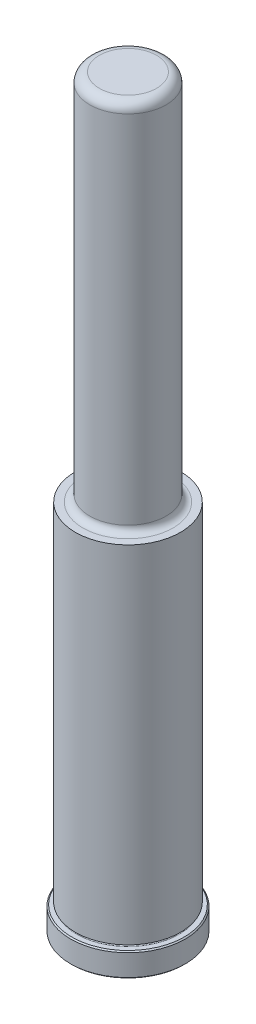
ISO-10303-21;
HEADER;
FILE_DESCRIPTION(('STEP AP214'),'2;1');
FILE_NAME('part.step','',(''),(''),'','','');
FILE_SCHEMA(('AUTOMOTIVE_DESIGN { 1 0 10303 214 1 1 1 1 }'));
ENDSEC;
DATA;
#1=APPLICATION_CONTEXT('core data for automotive mechanical design processes');
#2=APPLICATION_PROTOCOL_DEFINITION('international standard','automotive_design',2000,#1);
#3=PRODUCT_CONTEXT('',#1,'mechanical');
#4=PRODUCT('Part','Part','',(#3));
#5=PRODUCT_RELATED_PRODUCT_CATEGORY('part','',(#4));
#6=PRODUCT_DEFINITION_FORMATION('','',#4);
#7=PRODUCT_DEFINITION_CONTEXT('part definition',#1,'design');
#8=PRODUCT_DEFINITION('design','',#6,#7);
#9=PRODUCT_DEFINITION_SHAPE('','',#8);
#10=(LENGTH_UNIT() NAMED_UNIT(*) SI_UNIT(.MILLI.,.METRE.));
#11=(NAMED_UNIT(*) PLANE_ANGLE_UNIT() SI_UNIT($,.RADIAN.));
#12=(NAMED_UNIT(*) SI_UNIT($,.STERADIAN.) SOLID_ANGLE_UNIT());
#13=UNCERTAINTY_MEASURE_WITH_UNIT(LENGTH_MEASURE(1.E-05),#10,'distance_accuracy_value','');
#14=(GEOMETRIC_REPRESENTATION_CONTEXT(3) GLOBAL_UNCERTAINTY_ASSIGNED_CONTEXT((#13)) GLOBAL_UNIT_ASSIGNED_CONTEXT((#10,
#11,#12)) REPRESENTATION_CONTEXT('',''));
#15=CARTESIAN_POINT('',(0.,0.,0.));
#16=DIRECTION('',(0.,0.,1.));
#17=DIRECTION('',(1.,0.,0.));
#18=AXIS2_PLACEMENT_3D('',#15,#16,#17);
#19=CARTESIAN_POINT('',(0.,0.,0.));
#20=DIRECTION('',(0.,1.,0.));
#21=DIRECTION('',(0.,0.,1.));
#22=AXIS2_PLACEMENT_3D('',#19,#20,#21);
#23=PLANE('',#22);
#24=CARTESIAN_POINT('',(0.,0.,0.));
#25=DIRECTION('',(0.,1.,0.));
#26=DIRECTION('',(0.,0.,1.));
#27=AXIS2_PLACEMENT_3D('',#24,#25,#26);
#28=CIRCLE('',#27,18.669);
#29=CARTESIAN_POINT('',(0.,0.,18.669));
#30=VERTEX_POINT('',#29);
#31=EDGE_CURVE('E46',#30,#30,#28,.F.);
#32=ORIENTED_EDGE('',*,*,#31,.T.);
#33=EDGE_LOOP('',(#32));
#34=FACE_BOUND('',#33,.T.);
#35=ADVANCED_FACE('F31',(#34),#23,.F.);
#36=CARTESIAN_POINT('',(0.,0.,0.));
#37=DIRECTION('',(0.,1.,0.));
#38=DIRECTION('',(0.,0.,1.));
#39=AXIS2_PLACEMENT_3D('',#36,#37,#38);
#40=CYLINDRICAL_SURFACE('',#39,19.05);
#41=CARTESIAN_POINT('',(0.,0.380999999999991,0.));
#42=DIRECTION('',(0.,1.,0.));
#43=DIRECTION('',(0.,0.,1.));
#44=AXIS2_PLACEMENT_3D('',#41,#42,#43);
#45=CIRCLE('',#44,19.05);
#46=CARTESIAN_POINT('',(0.,0.380999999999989,19.05));
#47=VERTEX_POINT('',#46);
#48=EDGE_CURVE('E51',#47,#47,#45,.T.);
#49=ORIENTED_EDGE('',*,*,#48,.T.);
#50=EDGE_LOOP('',(#49));
#51=FACE_BOUND('',#50,.T.);
#52=CARTESIAN_POINT('',(0.,7.54379999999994,0.));
#53=DIRECTION('',(0.,-1.,0.));
#54=DIRECTION('',(0.,0.,-1.));
#55=AXIS2_PLACEMENT_3D('',#52,#53,#54);
#56=CIRCLE('',#55,19.05);
#57=CARTESIAN_POINT('',(0.,7.54379999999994,-19.05));
#58=VERTEX_POINT('',#57);
#59=EDGE_CURVE('E54',#58,#58,#56,.T.);
#60=ORIENTED_EDGE('',*,*,#59,.T.);
#61=EDGE_LOOP('',(#60));
#62=FACE_BOUND('',#61,.T.);
#63=ADVANCED_FACE('F110',(#51,#62),#40,.T.);
#64=CARTESIAN_POINT('',(0.,7.9248,-19.05));
#65=DIRECTION('',(0.,-1.,0.));
#66=DIRECTION('',(0.,0.,-1.));
#67=AXIS2_PLACEMENT_3D('',#64,#65,#66);
#68=PLANE('',#67);
#69=CARTESIAN_POINT('',(0.,7.9248,0.));
#70=DIRECTION('',(0.,-1.,0.));
#71=DIRECTION('',(0.,0.,-1.));
#72=AXIS2_PLACEMENT_3D('',#69,#70,#71);
#73=CIRCLE('',#72,18.6689999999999);
#74=CARTESIAN_POINT('',(0.,7.9248,-18.6689999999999));
#75=VERTEX_POINT('',#74);
#76=EDGE_CURVE('E42',#75,#75,#73,.F.);
#77=ORIENTED_EDGE('',*,*,#76,.T.);
#78=EDGE_LOOP('',(#77));
#79=FACE_BOUND('',#78,.T.);
#80=CARTESIAN_POINT('',(0.,7.9248,0.));
#81=DIRECTION('',(0.,1.,0.));
#82=DIRECTION('',(0.,0.,1.));
#83=AXIS2_PLACEMENT_3D('',#80,#81,#82);
#84=CIRCLE('',#83,17.0688);
#85=CARTESIAN_POINT('',(0.,7.92479999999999,17.0688));
#86=VERTEX_POINT('',#85);
#87=EDGE_CURVE('E57',#86,#86,#84,.T.);
#88=ORIENTED_EDGE('',*,*,#87,.F.);
#89=EDGE_LOOP('',(#88));
#90=FACE_BOUND('',#89,.T.);
#91=ADVANCED_FACE('F105',(#79,#90),#68,.F.);
#92=CARTESIAN_POINT('',(0.,8.3058,0.));
#93=DIRECTION('',(0.,1.,0.));
#94=DIRECTION('',(0.,0.,1.));
#95=AXIS2_PLACEMENT_3D('',#92,#93,#94);
#96=TOROIDAL_SURFACE('',#95,17.0688,0.381000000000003);
#97=CARTESIAN_POINT('',(0.,8.6868,0.));
#98=DIRECTION('',(0.,1.,0.));
#99=DIRECTION('',(0.,0.,1.));
#100=AXIS2_PLACEMENT_3D('',#97,#98,#99);
#101=CIRCLE('',#100,17.0688);
#102=CARTESIAN_POINT('',(0.,8.6868,17.0688));
#103=VERTEX_POINT('',#102);
#104=EDGE_CURVE('E60',#103,#103,#101,.T.);
#105=ORIENTED_EDGE('',*,*,#104,.F.);
#106=EDGE_LOOP('',(#105));
#107=FACE_BOUND('',#106,.T.);
#108=ORIENTED_EDGE('',*,*,#87,.T.);
#109=EDGE_LOOP('',(#108));
#110=FACE_BOUND('',#109,.T.);
#111=ADVANCED_FACE('F99',(#107,#110),#96,.F.);
#112=CARTESIAN_POINT('',(0.,8.6868,-17.0688));
#113=DIRECTION('',(0.,1.,0.));
#114=DIRECTION('',(0.,0.,1.));
#115=AXIS2_PLACEMENT_3D('',#112,#113,#114);
#116=PLANE('',#115);
#117=CARTESIAN_POINT('',(0.,8.6868,0.));
#118=DIRECTION('',(0.,1.,0.));
#119=DIRECTION('',(0.,0.,1.));
#120=AXIS2_PLACEMENT_3D('',#117,#118,#119);
#121=CIRCLE('',#120,17.4752);
#122=CARTESIAN_POINT('',(0.,8.6868,17.4752));
#123=VERTEX_POINT('',#122);
#124=EDGE_CURVE('E63',#123,#123,#121,.T.);
#125=ORIENTED_EDGE('',*,*,#124,.F.);
#126=EDGE_LOOP('',(#125));
#127=FACE_BOUND('',#126,.T.);
#128=ORIENTED_EDGE('',*,*,#104,.T.);
#129=EDGE_LOOP('',(#128));
#130=FACE_BOUND('',#129,.T.);
#131=ADVANCED_FACE('F93',(#127,#130),#116,.F.);
#132=CARTESIAN_POINT('',(0.,0.,0.));
#133=DIRECTION('',(0.,1.,0.));
#134=DIRECTION('',(0.,0.,1.));
#135=AXIS2_PLACEMENT_3D('',#132,#133,#134);
#136=CYLINDRICAL_SURFACE('',#135,17.4752);
#137=CARTESIAN_POINT('',(0.,123.825,0.));
#138=DIRECTION('',(0.,1.,0.));
#139=DIRECTION('',(0.,0.,1.));
#140=AXIS2_PLACEMENT_3D('',#137,#138,#139);
#141=CIRCLE('',#140,17.4752);
#142=CARTESIAN_POINT('',(0.,123.825,17.4752));
#143=VERTEX_POINT('',#142);
#144=EDGE_CURVE('E66',#143,#143,#141,.T.);
#145=ORIENTED_EDGE('',*,*,#144,.F.);
#146=EDGE_LOOP('',(#145));
#147=FACE_BOUND('',#146,.T.);
#148=ORIENTED_EDGE('',*,*,#124,.T.);
#149=EDGE_LOOP('',(#148));
#150=FACE_BOUND('',#149,.T.);
#151=ADVANCED_FACE('F87',(#147,#150),#136,.T.);
#152=CARTESIAN_POINT('',(0.,123.825,-17.4752));
#153=DIRECTION('',(0.,-1.,0.));
#154=DIRECTION('',(0.,0.,-1.));
#155=AXIS2_PLACEMENT_3D('',#152,#153,#154);
#156=PLANE('',#155);
#157=CARTESIAN_POINT('',(0.,123.825,0.));
#158=DIRECTION('',(0.,1.,0.));
#159=DIRECTION('',(0.,0.,1.));
#160=AXIS2_PLACEMENT_3D('',#157,#158,#159);
#161=CIRCLE('',#160,14.9733);
#162=CARTESIAN_POINT('',(0.,123.825,14.9733));
#163=VERTEX_POINT('',#162);
#164=EDGE_CURVE('E69',#163,#163,#161,.T.);
#165=ORIENTED_EDGE('',*,*,#164,.F.);
#166=EDGE_LOOP('',(#165));
#167=FACE_BOUND('',#166,.T.);
#168=ORIENTED_EDGE('',*,*,#144,.T.);
#169=EDGE_LOOP('',(#168));
#170=FACE_BOUND('',#169,.T.);
#171=ADVANCED_FACE('F81',(#167,#170),#156,.F.);
#172=CARTESIAN_POINT('',(0.,126.111,0.));
#173=DIRECTION('',(0.,1.,0.));
#174=DIRECTION('',(0.,0.,1.));
#175=AXIS2_PLACEMENT_3D('',#172,#173,#174);
#176=TOROIDAL_SURFACE('',#175,14.9733,2.28600000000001);
#177=CARTESIAN_POINT('',(0.,126.111,0.));
#178=DIRECTION('',(0.,1.,0.));
#179=DIRECTION('',(0.,0.,1.));
#180=AXIS2_PLACEMENT_3D('',#177,#178,#179);
#181=CIRCLE('',#180,12.6873);
#182=CARTESIAN_POINT('',(0.,126.111,12.6873));
#183=VERTEX_POINT('',#182);
#184=EDGE_CURVE('E72',#183,#183,#181,.T.);
#185=ORIENTED_EDGE('',*,*,#184,.F.);
#186=EDGE_LOOP('',(#185));
#187=FACE_BOUND('',#186,.T.);
#188=ORIENTED_EDGE('',*,*,#164,.T.);
#189=EDGE_LOOP('',(#188));
#190=FACE_BOUND('',#189,.T.);
#191=ADVANCED_FACE('F78',(#187,#190),#176,.F.);
#192=CARTESIAN_POINT('',(0.,0.,0.));
#193=DIRECTION('',(0.,1.,0.));
#194=DIRECTION('',(0.,0.,1.));
#195=AXIS2_PLACEMENT_3D('',#192,#193,#194);
#196=CYLINDRICAL_SURFACE('',#195,12.6873);
#197=CARTESIAN_POINT('',(0.,244.475,0.));
#198=DIRECTION('',(0.,-1.,0.));
#199=DIRECTION('',(0.,0.,-1.));
#200=AXIS2_PLACEMENT_3D('',#197,#198,#199);
#201=CIRCLE('',#200,12.6873);
#202=CARTESIAN_POINT('',(0.,244.475,-12.6873));
#203=VERTEX_POINT('',#202);
#204=EDGE_CURVE('E10',#203,#203,#201,.T.);
#205=ORIENTED_EDGE('',*,*,#204,.T.);
#206=EDGE_LOOP('',(#205));
#207=FACE_BOUND('',#206,.T.);
#208=ORIENTED_EDGE('',*,*,#184,.T.);
#209=EDGE_LOOP('',(#208));
#210=FACE_BOUND('',#209,.T.);
#211=ADVANCED_FACE('F76',(#207,#210),#196,.T.);
#212=CARTESIAN_POINT('',(0.,247.65,-12.6873));
#213=DIRECTION('',(0.,-1.,0.));
#214=DIRECTION('',(0.,0.,-1.));
#215=AXIS2_PLACEMENT_3D('',#212,#213,#214);
#216=PLANE('',#215);
#217=CARTESIAN_POINT('',(0.,247.65,0.));
#218=DIRECTION('',(0.,-1.,0.));
#219=DIRECTION('',(0.,0.,-1.));
#220=AXIS2_PLACEMENT_3D('',#217,#218,#219);
#221=CIRCLE('',#220,9.5123);
#222=CARTESIAN_POINT('',(0.,247.65,-9.51229999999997));
#223=VERTEX_POINT('',#222);
#224=EDGE_CURVE('E38',#223,#223,#221,.F.);
#225=ORIENTED_EDGE('',*,*,#224,.T.);
#226=EDGE_LOOP('',(#225));
#227=FACE_BOUND('',#226,.T.);
#228=ADVANCED_FACE('F127',(#227),#216,.F.);
#229=CARTESIAN_POINT('',(0.,0.380999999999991,0.));
#230=DIRECTION('',(0.,1.,0.));
#231=DIRECTION('',(0.,0.,1.));
#232=AXIS2_PLACEMENT_3D('',#229,#230,#231);
#233=CONICAL_SURFACE('',#232,19.05,0.785398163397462);
#234=CARTESIAN_POINT('',(0.,0.,18.669));
#235=CARTESIAN_POINT('',(0.,0.00396874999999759,18.67296875));
#236=CARTESIAN_POINT('',(0.,0.00793749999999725,18.6769375));
#237=CARTESIAN_POINT('',(0.,0.0158749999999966,18.684875));
#238=CARTESIAN_POINT('',(0.,0.0198437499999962,18.68884375));
#239=CARTESIAN_POINT('',(0.,0.027781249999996,18.69678125));
#240=CARTESIAN_POINT('',(0.,0.031749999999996,18.70075));
#241=CARTESIAN_POINT('',(0.,0.0396874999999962,18.7086875));
#242=CARTESIAN_POINT('',(0.,0.0436562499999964,18.71265625));
#243=CARTESIAN_POINT('',(0.,0.051593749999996,18.72059375));
#244=CARTESIAN_POINT('',(0.,0.0555624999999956,18.7245625));
#245=CARTESIAN_POINT('',(0.,0.0634999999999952,18.7325));
#246=CARTESIAN_POINT('',(0.,0.0674687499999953,18.73646875));
#247=CARTESIAN_POINT('',(0.,0.0754062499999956,18.74440625));
#248=CARTESIAN_POINT('',(0.,0.0793749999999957,18.748375));
#249=CARTESIAN_POINT('',(0.,0.0873124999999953,18.7563125));
#250=CARTESIAN_POINT('',(0.,0.0912812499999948,18.76028125));
#251=CARTESIAN_POINT('',(0.,0.0992187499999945,18.76821875));
#252=CARTESIAN_POINT('',(0.,0.103187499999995,18.7721875));
#253=CARTESIAN_POINT('',(0.,0.111124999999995,18.780125));
#254=CARTESIAN_POINT('',(0.,0.115093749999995,18.78409375));
#255=CARTESIAN_POINT('',(0.,0.123031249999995,18.79203125));
#256=CARTESIAN_POINT('',(0.,0.126999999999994,18.796));
#257=CARTESIAN_POINT('',(0.,0.134937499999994,18.8039375));
#258=CARTESIAN_POINT('',(0.,0.138906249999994,18.80790625));
#259=CARTESIAN_POINT('',(0.,0.146843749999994,18.81584375));
#260=CARTESIAN_POINT('',(0.,0.150812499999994,18.8198125));
#261=CARTESIAN_POINT('',(0.,0.158749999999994,18.82775));
#262=CARTESIAN_POINT('',(0.,0.162718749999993,18.83171875));
#263=CARTESIAN_POINT('',(0.,0.170656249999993,18.83965625));
#264=CARTESIAN_POINT('',(0.,0.174624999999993,18.843625));
#265=CARTESIAN_POINT('',(0.,0.182562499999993,18.8515625));
#266=CARTESIAN_POINT('',(0.,0.186531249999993,18.85553125));
#267=CARTESIAN_POINT('',(0.,0.194468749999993,18.86346875));
#268=CARTESIAN_POINT('',(0.,0.198437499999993,18.8674375));
#269=CARTESIAN_POINT('',(0.,0.206374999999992,18.875375));
#270=CARTESIAN_POINT('',(0.,0.210343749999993,18.87934375));
#271=CARTESIAN_POINT('',(0.,0.218281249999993,18.88728125));
#272=CARTESIAN_POINT('',(0.,0.222249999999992,18.89125));
#273=CARTESIAN_POINT('',(0.,0.230187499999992,18.8991875));
#274=CARTESIAN_POINT('',(0.,0.234156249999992,18.90315625));
#275=CARTESIAN_POINT('',(0.,0.242093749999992,18.91109375));
#276=CARTESIAN_POINT('',(0.,0.246062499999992,18.9150625));
#277=CARTESIAN_POINT('',(0.,0.253999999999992,18.923));
#278=CARTESIAN_POINT('',(0.,0.257968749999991,18.92696875));
#279=CARTESIAN_POINT('',(0.,0.265906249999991,18.93490625));
#280=CARTESIAN_POINT('',(0.,0.269874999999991,18.938875));
#281=CARTESIAN_POINT('',(0.,0.277812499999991,18.9468125));
#282=CARTESIAN_POINT('',(0.,0.281781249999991,18.95078125));
#283=CARTESIAN_POINT('',(0.,0.289718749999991,18.95871875));
#284=CARTESIAN_POINT('',(0.,0.293687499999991,18.9626875));
#285=CARTESIAN_POINT('',(0.,0.30162499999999,18.970625));
#286=CARTESIAN_POINT('',(0.,0.30559374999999,18.97459375));
#287=CARTESIAN_POINT('',(0.,0.313531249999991,18.98253125));
#288=CARTESIAN_POINT('',(0.,0.317499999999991,18.9865));
#289=CARTESIAN_POINT('',(0.,0.32543749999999,18.9944375));
#290=CARTESIAN_POINT('',(0.,0.32940624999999,18.99840625));
#291=CARTESIAN_POINT('',(0.,0.33734374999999,19.00634375));
#292=CARTESIAN_POINT('',(0.,0.34131249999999,19.0103125));
#293=CARTESIAN_POINT('',(0.,0.34924999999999,19.01825));
#294=CARTESIAN_POINT('',(0.,0.35321874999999,19.02221875));
#295=CARTESIAN_POINT('',(0.,0.36115624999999,19.03015625));
#296=CARTESIAN_POINT('',(0.,0.365124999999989,19.034125));
#297=CARTESIAN_POINT('',(0.,0.373062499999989,19.0420625));
#298=CARTESIAN_POINT('',(0.,0.377031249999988,19.04603125));
#299=CARTESIAN_POINT('',(0.,0.380999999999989,19.05));
#300=B_SPLINE_CURVE_WITH_KNOTS('',3,(#234,#235,#236,#237,#238,#239,#240,#241,#242,#243,#244,
#245,#246,#247,#248,#249,#250,#251,#252,#253,#254,#255,#256,#257,#258,#259,#260,#261,#262,#263,
#264,#265,#266,#267,#268,#269,#270,#271,#272,#273,#274,#275,#276,#277,#278,#279,#280,#281,#282,
#283,#284,#285,#286,#287,#288,#289,#290,#291,#292,#293,#294,#295,#296,#297,#298,#299),
.UNSPECIFIED.,.F.,.F.,(4,2,2,2,2,2,2,2,2,2,2,2,2,2,2,2,2,2,2,2,2,2,2,2,2,2,2,2,2,2,2,2,4),(0.,
0.0168379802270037,0.0336759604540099,0.0505139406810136,0.0673519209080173,0.0841899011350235,
0.101027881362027,0.117865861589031,0.134703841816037,0.151541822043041,0.168379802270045,
0.185217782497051,0.202055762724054,0.218893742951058,0.235731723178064,0.252569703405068,
0.269407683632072,0.286245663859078,0.303083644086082,0.319921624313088,0.336759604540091,
0.353597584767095,0.370435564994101,0.387273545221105,0.404111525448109,0.420949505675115,
0.437787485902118,0.454625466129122,0.471463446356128,0.488301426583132,0.505139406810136,
0.521977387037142,0.538815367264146),.UNSPECIFIED.);
#301=EDGE_CURVE('BSEAM124',#30,#47,#300,.T.);
#302=ORIENTED_EDGE('',*,*,#31,.F.);
#303=ORIENTED_EDGE('',*,*,#48,.F.);
#304=ORIENTED_EDGE('',*,*,#301,.T.);
#305=ORIENTED_EDGE('',*,*,#301,.F.);
#306=EDGE_LOOP('',(#302,#304,#303,#305));
#307=FACE_BOUND('',#306,.T.);
#308=ADVANCED_FACE('F124',(#307),#233,.T.);
#309=CARTESIAN_POINT('',(0.,7.9248,0.));
#310=DIRECTION('',(0.,-1.,0.));
#311=DIRECTION('',(0.,0.,-1.));
#312=AXIS2_PLACEMENT_3D('',#309,#310,#311);
#313=CONICAL_SURFACE('',#312,18.6689999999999,0.785398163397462);
#314=ORIENTED_EDGE('',*,*,#59,.F.);
#315=EDGE_LOOP('',(#314));
#316=FACE_BOUND('',#315,.T.);
#317=ORIENTED_EDGE('',*,*,#76,.F.);
#318=EDGE_LOOP('',(#317));
#319=FACE_BOUND('',#318,.T.);
#320=ADVANCED_FACE('F126',(#316,#319),#313,.T.);
#321=CARTESIAN_POINT('',(0.,244.475,0.));
#322=DIRECTION('',(0.,-1.,0.));
#323=DIRECTION('',(0.,0.,-1.));
#324=AXIS2_PLACEMENT_3D('',#321,#322,#323);
#325=TOROIDAL_SURFACE('',#324,9.5123,3.175);
#326=ORIENTED_EDGE('',*,*,#204,.F.);
#327=EDGE_LOOP('',(#326));
#328=FACE_BOUND('',#327,.T.);
#329=ORIENTED_EDGE('',*,*,#224,.F.);
#330=EDGE_LOOP('',(#329));
#331=FACE_BOUND('',#330,.T.);
#332=ADVANCED_FACE('F33',(#328,#331),#325,.T.);
#333=CLOSED_SHELL('',(#35,#63,#91,#111,#131,#151,#171,#191,#211,#228,#308,#320,#332));
#334=MANIFOLD_SOLID_BREP('B2',#333);
#335=ADVANCED_BREP_SHAPE_REPRESENTATION('',(#18,#334),#14);
#336=SHAPE_DEFINITION_REPRESENTATION(#9,#335);
ENDSEC;
END-ISO-10303-21;
